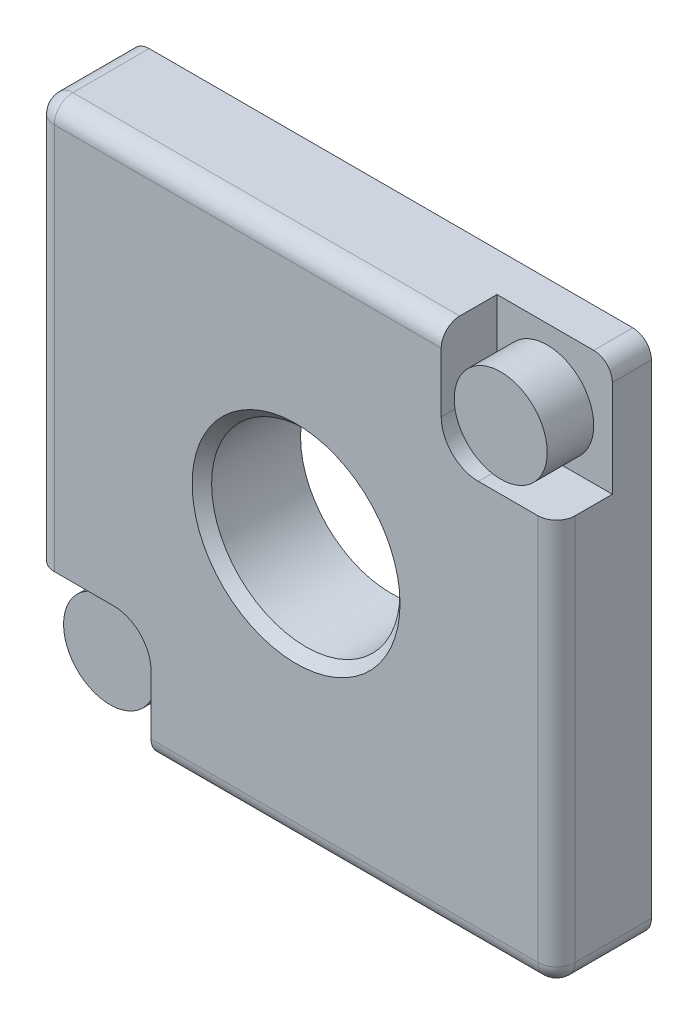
ISO-10303-21;
HEADER;
FILE_DESCRIPTION(('STEP AP214'),'2;1');
FILE_NAME('part.step','',(''),(''),'','','');
FILE_SCHEMA(('AUTOMOTIVE_DESIGN { 1 0 10303 214 1 1 1 1 }'));
ENDSEC;
DATA;
#1=APPLICATION_CONTEXT('core data for automotive mechanical design processes');
#2=APPLICATION_PROTOCOL_DEFINITION('international standard','automotive_design',2000,#1);
#3=PRODUCT_CONTEXT('',#1,'mechanical');
#4=PRODUCT('Part','Part','',(#3));
#5=PRODUCT_RELATED_PRODUCT_CATEGORY('part','',(#4));
#6=PRODUCT_DEFINITION_FORMATION('','',#4);
#7=PRODUCT_DEFINITION_CONTEXT('part definition',#1,'design');
#8=PRODUCT_DEFINITION('design','',#6,#7);
#9=PRODUCT_DEFINITION_SHAPE('','',#8);
#10=(LENGTH_UNIT() NAMED_UNIT(*) SI_UNIT(.MILLI.,.METRE.));
#11=(NAMED_UNIT(*) PLANE_ANGLE_UNIT() SI_UNIT($,.RADIAN.));
#12=(NAMED_UNIT(*) SI_UNIT($,.STERADIAN.) SOLID_ANGLE_UNIT());
#13=UNCERTAINTY_MEASURE_WITH_UNIT(LENGTH_MEASURE(1.E-05),#10,'distance_accuracy_value','');
#14=(GEOMETRIC_REPRESENTATION_CONTEXT(3) GLOBAL_UNCERTAINTY_ASSIGNED_CONTEXT((#13)) GLOBAL_UNIT_ASSIGNED_CONTEXT((#10,
#11,#12)) REPRESENTATION_CONTEXT('',''));
#15=CARTESIAN_POINT('',(0.,0.,0.));
#16=DIRECTION('',(0.,0.,1.));
#17=DIRECTION('',(1.,0.,0.));
#18=AXIS2_PLACEMENT_3D('',#15,#16,#17);
#19=CARTESIAN_POINT('',(-13.,-13.,-5.1));
#20=DIRECTION('',(0.,0.,1.));
#21=DIRECTION('',(1.,0.,0.));
#22=AXIS2_PLACEMENT_3D('',#19,#20,#21);
#23=CYLINDRICAL_SURFACE('',#22,1.);
#24=DIRECTION('',(0.,0.,1.));
#25=VECTOR('',#24,1.);
#26=CARTESIAN_POINT('',(-13.,-14.,-5.1));
#27=LINE('',#26,#25);
#28=CARTESIAN_POINT('',(-13.,-14.0000000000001,-3.));
#29=VERTEX_POINT('',#28);
#30=CARTESIAN_POINT('',(-13.,-14.,-5.1));
#31=VERTEX_POINT('',#30);
#32=EDGE_CURVE('E263',#29,#31,#27,.F.);
#33=ORIENTED_EDGE('',*,*,#32,.F.);
#34=CARTESIAN_POINT('',(-13.,-13.,-3.));
#35=DIRECTION('',(0.,0.,1.));
#36=DIRECTION('',(1.,0.,0.));
#37=AXIS2_PLACEMENT_3D('',#34,#35,#36);
#38=CIRCLE('',#37,1.);
#39=CARTESIAN_POINT('',(-13.9999999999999,-13.,-3.));
#40=VERTEX_POINT('',#39);
#41=EDGE_CURVE('E26',#29,#40,#38,.F.);
#42=ORIENTED_EDGE('',*,*,#41,.T.);
#43=DIRECTION('',(0.,0.,1.));
#44=VECTOR('',#43,1.);
#45=CARTESIAN_POINT('',(-14.,-13.,-5.1));
#46=LINE('',#45,#44);
#47=CARTESIAN_POINT('',(-14.,-13.,-5.1));
#48=VERTEX_POINT('',#47);
#49=EDGE_CURVE('E272',#48,#40,#46,.T.);
#50=ORIENTED_EDGE('',*,*,#49,.F.);
#51=CARTESIAN_POINT('',(-13.,-13.,-5.1));
#52=DIRECTION('',(0.,0.,-1.));
#53=DIRECTION('',(-1.,0.,0.));
#54=AXIS2_PLACEMENT_3D('',#51,#52,#53);
#55=CIRCLE('',#54,1.);
#56=EDGE_CURVE('E257',#31,#48,#55,.T.);
#57=ORIENTED_EDGE('',*,*,#56,.F.);
#58=EDGE_LOOP('',(#33,#42,#50,#57));
#59=FACE_BOUND('',#58,.T.);
#60=ADVANCED_FACE('F17',(#59),#23,.T.);
#61=CARTESIAN_POINT('',(13.,13.,-5.1));
#62=DIRECTION('',(0.,0.,1.));
#63=DIRECTION('',(1.,0.,0.));
#64=AXIS2_PLACEMENT_3D('',#61,#62,#63);
#65=CYLINDRICAL_SURFACE('',#64,1.);
#66=DIRECTION('',(0.,0.,1.));
#67=VECTOR('',#66,1.);
#68=CARTESIAN_POINT('',(13.,14.,-5.1));
#69=LINE('',#68,#67);
#70=CARTESIAN_POINT('',(13.,14.,-3.));
#71=VERTEX_POINT('',#70);
#72=CARTESIAN_POINT('',(13.,14.,-5.1));
#73=VERTEX_POINT('',#72);
#74=EDGE_CURVE('E246',#71,#73,#69,.F.);
#75=ORIENTED_EDGE('',*,*,#74,.F.);
#76=CARTESIAN_POINT('',(13.,13.,-3.));
#77=DIRECTION('',(0.,0.,1.));
#78=DIRECTION('',(1.,0.,0.));
#79=AXIS2_PLACEMENT_3D('',#76,#77,#78);
#80=CIRCLE('',#79,1.);
#81=CARTESIAN_POINT('',(14.,13.,-3.));
#82=VERTEX_POINT('',#81);
#83=EDGE_CURVE('E295',#71,#82,#80,.F.);
#84=ORIENTED_EDGE('',*,*,#83,.T.);
#85=DIRECTION('',(0.,0.,1.));
#86=VECTOR('',#85,1.);
#87=CARTESIAN_POINT('',(14.,13.,-5.1));
#88=LINE('',#87,#86);
#89=CARTESIAN_POINT('',(14.,13.,-5.1));
#90=VERTEX_POINT('',#89);
#91=EDGE_CURVE('E252',#90,#82,#88,.T.);
#92=ORIENTED_EDGE('',*,*,#91,.F.);
#93=CARTESIAN_POINT('',(13.,13.,-5.1));
#94=DIRECTION('',(0.,0.,-1.));
#95=DIRECTION('',(-1.,0.,0.));
#96=AXIS2_PLACEMENT_3D('',#93,#94,#95);
#97=CIRCLE('',#96,1.);
#98=EDGE_CURVE('E261',#73,#90,#97,.T.);
#99=ORIENTED_EDGE('',*,*,#98,.F.);
#100=EDGE_LOOP('',(#75,#84,#92,#99));
#101=FACE_BOUND('',#100,.T.);
#102=ADVANCED_FACE('F328',(#101),#65,.T.);
#103=CARTESIAN_POINT('',(14.,14.,-5.1));
#104=DIRECTION('',(1.,0.,0.));
#105=DIRECTION('',(0.,1.,0.));
#106=AXIS2_PLACEMENT_3D('',#103,#104,#105);
#107=PLANE('',#106);
#108=DIRECTION('',(0.,0.,1.));
#109=VECTOR('',#108,1.);
#110=CARTESIAN_POINT('',(14.,7.8,-3.));
#111=LINE('',#110,#109);
#112=CARTESIAN_POINT('',(14.,7.8,-3.));
#113=VERTEX_POINT('',#112);
#114=CARTESIAN_POINT('',(14.,7.8,-1.));
#115=VERTEX_POINT('',#114);
#116=EDGE_CURVE('E208',#113,#115,#111,.T.);
#117=ORIENTED_EDGE('',*,*,#116,.T.);
#118=DIRECTION('',(0.,1.,0.));
#119=VECTOR('',#118,1.);
#120=CARTESIAN_POINT('',(14.,-14.,-1.));
#121=LINE('',#120,#119);
#122=CARTESIAN_POINT('',(14.,-13.,-1.));
#123=VERTEX_POINT('',#122);
#124=EDGE_CURVE('E250',#115,#123,#121,.F.);
#125=ORIENTED_EDGE('',*,*,#124,.T.);
#126=DIRECTION('',(0.,0.,1.));
#127=VECTOR('',#126,1.);
#128=CARTESIAN_POINT('',(14.,-13.,-5.1));
#129=LINE('',#128,#127);
#130=CARTESIAN_POINT('',(14.,-13.,-5.1));
#131=VERTEX_POINT('',#130);
#132=EDGE_CURVE('E248',#123,#131,#129,.F.);
#133=ORIENTED_EDGE('',*,*,#132,.T.);
#134=DIRECTION('',(0.,1.,0.));
#135=VECTOR('',#134,1.);
#136=CARTESIAN_POINT('',(14.,14.,-5.1));
#137=LINE('',#136,#135);
#138=EDGE_CURVE('E218',#131,#90,#137,.T.);
#139=ORIENTED_EDGE('',*,*,#138,.T.);
#140=ORIENTED_EDGE('',*,*,#91,.T.);
#141=DIRECTION('',(0.,1.,0.));
#142=VECTOR('',#141,1.);
#143=CARTESIAN_POINT('',(14.,14.,-3.));
#144=LINE('',#143,#142);
#145=EDGE_CURVE('E189',#113,#82,#144,.T.);
#146=ORIENTED_EDGE('',*,*,#145,.F.);
#147=EDGE_LOOP('',(#117,#125,#133,#139,#140,#146));
#148=FACE_BOUND('',#147,.T.);
#149=ADVANCED_FACE('F331',(#148),#107,.T.);
#150=CARTESIAN_POINT('',(14.,-14.,-5.1));
#151=DIRECTION('',(0.,-1.,0.));
#152=DIRECTION('',(1.,0.,0.));
#153=AXIS2_PLACEMENT_3D('',#150,#151,#152);
#154=PLANE('',#153);
#155=DIRECTION('',(0.,0.,1.));
#156=VECTOR('',#155,1.);
#157=CARTESIAN_POINT('',(-7.7999999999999,-14.,-3.));
#158=LINE('',#157,#156);
#159=CARTESIAN_POINT('',(-7.7999999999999,-14.,-3.));
#160=VERTEX_POINT('',#159);
#161=CARTESIAN_POINT('',(-7.7999999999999,-14.,-1.));
#162=VERTEX_POINT('',#161);
#163=EDGE_CURVE('E162',#160,#162,#158,.T.);
#164=ORIENTED_EDGE('',*,*,#163,.F.);
#165=DIRECTION('',(1.,0.,0.));
#166=VECTOR('',#165,1.);
#167=CARTESIAN_POINT('',(-13.9999999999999,-14.0000000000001,-3.));
#168=LINE('',#167,#166);
#169=EDGE_CURVE('E149',#29,#160,#168,.T.);
#170=ORIENTED_EDGE('',*,*,#169,.F.);
#171=ORIENTED_EDGE('',*,*,#32,.T.);
#172=DIRECTION('',(1.,0.,0.));
#173=VECTOR('',#172,1.);
#174=CARTESIAN_POINT('',(14.,-14.,-5.1));
#175=LINE('',#174,#173);
#176=CARTESIAN_POINT('',(13.,-14.,-5.1));
#177=VERTEX_POINT('',#176);
#178=EDGE_CURVE('E228',#31,#177,#175,.T.);
#179=ORIENTED_EDGE('',*,*,#178,.T.);
#180=DIRECTION('',(0.,0.,1.));
#181=VECTOR('',#180,1.);
#182=CARTESIAN_POINT('',(13.,-14.,-5.1));
#183=LINE('',#182,#181);
#184=CARTESIAN_POINT('',(13.,-14.,-1.));
#185=VERTEX_POINT('',#184);
#186=EDGE_CURVE('E266',#177,#185,#183,.T.);
#187=ORIENTED_EDGE('',*,*,#186,.T.);
#188=DIRECTION('',(1.,0.,0.));
#189=VECTOR('',#188,1.);
#190=CARTESIAN_POINT('',(-14.,-14.,-1.));
#191=LINE('',#190,#189);
#192=EDGE_CURVE('E172',#185,#162,#191,.F.);
#193=ORIENTED_EDGE('',*,*,#192,.T.);
#194=EDGE_LOOP('',(#164,#170,#171,#179,#187,#193));
#195=FACE_BOUND('',#194,.T.);
#196=ADVANCED_FACE('F170',(#195),#154,.T.);
#197=CARTESIAN_POINT('',(-14.,14.,-5.1));
#198=DIRECTION('',(-1.,0.,0.));
#199=DIRECTION('',(0.,-1.,0.));
#200=AXIS2_PLACEMENT_3D('',#197,#198,#199);
#201=PLANE('',#200);
#202=DIRECTION('',(0.,0.,1.));
#203=VECTOR('',#202,1.);
#204=CARTESIAN_POINT('',(-13.9999999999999,-7.80000000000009,-3.));
#205=LINE('',#204,#203);
#206=CARTESIAN_POINT('',(-13.9999999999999,-7.80000000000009,-3.));
#207=VERTEX_POINT('',#206);
#208=CARTESIAN_POINT('',(-13.9999999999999,-7.80000000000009,-1.));
#209=VERTEX_POINT('',#208);
#210=EDGE_CURVE('E188',#207,#209,#205,.T.);
#211=ORIENTED_EDGE('',*,*,#210,.T.);
#212=DIRECTION('',(0.,-1.,0.));
#213=VECTOR('',#212,1.);
#214=CARTESIAN_POINT('',(-14.,14.,-1.));
#215=LINE('',#214,#213);
#216=CARTESIAN_POINT('',(-14.,13.,-1.));
#217=VERTEX_POINT('',#216);
#218=EDGE_CURVE('E270',#209,#217,#215,.F.);
#219=ORIENTED_EDGE('',*,*,#218,.T.);
#220=DIRECTION('',(0.,0.,1.));
#221=VECTOR('',#220,1.);
#222=CARTESIAN_POINT('',(-14.,13.,-5.1));
#223=LINE('',#222,#221);
#224=CARTESIAN_POINT('',(-14.,13.,-5.1));
#225=VERTEX_POINT('',#224);
#226=EDGE_CURVE('E268',#217,#225,#223,.F.);
#227=ORIENTED_EDGE('',*,*,#226,.T.);
#228=DIRECTION('',(0.,-1.,0.));
#229=VECTOR('',#228,1.);
#230=CARTESIAN_POINT('',(-14.,14.,-5.1));
#231=LINE('',#230,#229);
#232=EDGE_CURVE('E225',#225,#48,#231,.T.);
#233=ORIENTED_EDGE('',*,*,#232,.T.);
#234=ORIENTED_EDGE('',*,*,#49,.T.);
#235=DIRECTION('',(0.,-1.,0.));
#236=VECTOR('',#235,1.);
#237=CARTESIAN_POINT('',(-13.9999999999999,-14.0000000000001,-3.));
#238=LINE('',#237,#236);
#239=EDGE_CURVE('E158',#207,#40,#238,.T.);
#240=ORIENTED_EDGE('',*,*,#239,.F.);
#241=EDGE_LOOP('',(#211,#219,#227,#233,#234,#240));
#242=FACE_BOUND('',#241,.T.);
#243=ADVANCED_FACE('F306',(#242),#201,.T.);
#244=CARTESIAN_POINT('',(14.,14.,-5.1));
#245=DIRECTION('',(0.,1.,0.));
#246=DIRECTION('',(-1.,0.,0.));
#247=AXIS2_PLACEMENT_3D('',#244,#245,#246);
#248=PLANE('',#247);
#249=DIRECTION('',(0.,0.,1.));
#250=VECTOR('',#249,1.);
#251=CARTESIAN_POINT('',(7.8,14.,-3.));
#252=LINE('',#251,#250);
#253=CARTESIAN_POINT('',(7.8,14.,-3.));
#254=VERTEX_POINT('',#253);
#255=CARTESIAN_POINT('',(7.8,14.,-1.));
#256=VERTEX_POINT('',#255);
#257=EDGE_CURVE('E41',#254,#256,#252,.T.);
#258=ORIENTED_EDGE('',*,*,#257,.F.);
#259=DIRECTION('',(-1.,0.,0.));
#260=VECTOR('',#259,1.);
#261=CARTESIAN_POINT('',(14.,14.,-3.));
#262=LINE('',#261,#260);
#263=EDGE_CURVE('E191',#71,#254,#262,.T.);
#264=ORIENTED_EDGE('',*,*,#263,.F.);
#265=ORIENTED_EDGE('',*,*,#74,.T.);
#266=DIRECTION('',(-1.,0.,0.));
#267=VECTOR('',#266,1.);
#268=CARTESIAN_POINT('',(14.,14.,-5.1));
#269=LINE('',#268,#267);
#270=CARTESIAN_POINT('',(-13.,14.,-5.1));
#271=VERTEX_POINT('',#270);
#272=EDGE_CURVE('E221',#73,#271,#269,.T.);
#273=ORIENTED_EDGE('',*,*,#272,.T.);
#274=DIRECTION('',(0.,0.,1.));
#275=VECTOR('',#274,1.);
#276=CARTESIAN_POINT('',(-13.,14.,-5.1));
#277=LINE('',#276,#275);
#278=CARTESIAN_POINT('',(-13.,14.,-1.));
#279=VERTEX_POINT('',#278);
#280=EDGE_CURVE('E241',#271,#279,#277,.T.);
#281=ORIENTED_EDGE('',*,*,#280,.T.);
#282=DIRECTION('',(-1.,0.,0.));
#283=VECTOR('',#282,1.);
#284=CARTESIAN_POINT('',(14.,14.,-1.));
#285=LINE('',#284,#283);
#286=EDGE_CURVE('E243',#279,#256,#285,.F.);
#287=ORIENTED_EDGE('',*,*,#286,.T.);
#288=EDGE_LOOP('',(#258,#264,#265,#273,#281,#287));
#289=FACE_BOUND('',#288,.T.);
#290=ADVANCED_FACE('F321',(#289),#248,.T.);
#291=CARTESIAN_POINT('',(14.,-14.,-5.1));
#292=DIRECTION('',(0.,0.,-1.));
#293=DIRECTION('',(-1.,0.,0.));
#294=AXIS2_PLACEMENT_3D('',#291,#292,#293);
#295=PLANE('',#294);
#296=CARTESIAN_POINT('',(0.,0.,-5.1));
#297=DIRECTION('',(0.,0.,-1.));
#298=DIRECTION('',(-1.,0.,0.));
#299=AXIS2_PLACEMENT_3D('',#296,#297,#298);
#300=CIRCLE('',#299,4.86105873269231);
#301=CARTESIAN_POINT('',(-4.86105873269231,0.,-5.1));
#302=VERTEX_POINT('',#301);
#303=EDGE_CURVE('E21',#302,#302,#300,.F.);
#304=ORIENTED_EDGE('',*,*,#303,.T.);
#305=EDGE_LOOP('',(#304));
#306=FACE_BOUND('',#305,.T.);
#307=ORIENTED_EDGE('',*,*,#272,.F.);
#308=ORIENTED_EDGE('',*,*,#98,.T.);
#309=ORIENTED_EDGE('',*,*,#138,.F.);
#310=CARTESIAN_POINT('',(13.,-13.,-5.1));
#311=DIRECTION('',(0.,0.,-1.));
#312=DIRECTION('',(-1.,0.,0.));
#313=AXIS2_PLACEMENT_3D('',#310,#311,#312);
#314=CIRCLE('',#313,1.);
#315=EDGE_CURVE('E259',#131,#177,#314,.T.);
#316=ORIENTED_EDGE('',*,*,#315,.T.);
#317=ORIENTED_EDGE('',*,*,#178,.F.);
#318=ORIENTED_EDGE('',*,*,#56,.T.);
#319=ORIENTED_EDGE('',*,*,#232,.F.);
#320=CARTESIAN_POINT('',(-13.,13.,-5.1));
#321=DIRECTION('',(0.,0.,-1.));
#322=DIRECTION('',(-1.,0.,0.));
#323=AXIS2_PLACEMENT_3D('',#320,#321,#322);
#324=CIRCLE('',#323,1.);
#325=EDGE_CURVE('E255',#225,#271,#324,.T.);
#326=ORIENTED_EDGE('',*,*,#325,.T.);
#327=EDGE_LOOP('',(#307,#308,#309,#316,#317,#318,#319,#326));
#328=FACE_BOUND('',#327,.T.);
#329=ADVANCED_FACE('F312',(#306,#328),#295,.T.);
#330=CARTESIAN_POINT('',(14.,-14.,0.));
#331=DIRECTION('',(0.,0.,-1.));
#332=DIRECTION('',(-1.,0.,0.));
#333=AXIS2_PLACEMENT_3D('',#330,#331,#332);
#334=PLANE('',#333);
#335=CARTESIAN_POINT('',(0.,0.,0.));
#336=DIRECTION('',(0.,0.,1.));
#337=DIRECTION('',(1.,0.,0.));
#338=AXIS2_PLACEMENT_3D('',#335,#336,#337);
#339=CIRCLE('',#338,5.58716106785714);
#340=CARTESIAN_POINT('',(5.58716106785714,0.,0.));
#341=VERTEX_POINT('',#340);
#342=EDGE_CURVE('E372',#341,#341,#339,.T.);
#343=ORIENTED_EDGE('',*,*,#342,.F.);
#344=EDGE_LOOP('',(#343));
#345=FACE_BOUND('',#344,.T.);
#346=DIRECTION('',(0.,-1.,0.));
#347=VECTOR('',#346,1.);
#348=CARTESIAN_POINT('',(-13.,-14.,0.));
#349=LINE('',#348,#347);
#350=CARTESIAN_POINT('',(-13.,13.,0.));
#351=VERTEX_POINT('',#350);
#352=CARTESIAN_POINT('',(-13.,-7.80000000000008,0.));
#353=VERTEX_POINT('',#352);
#354=EDGE_CURVE('E231',#351,#353,#349,.T.);
#355=ORIENTED_EDGE('',*,*,#354,.T.);
#356=DIRECTION('',(-1.,0.,0.));
#357=VECTOR('',#356,1.);
#358=CARTESIAN_POINT('',(-13.9999999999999,-7.80000000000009,0.));
#359=LINE('',#358,#357);
#360=CARTESIAN_POINT('',(-9.79999999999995,-7.80000000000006,0.));
#361=VERTEX_POINT('',#360);
#362=EDGE_CURVE('E33',#361,#353,#359,.T.);
#363=ORIENTED_EDGE('',*,*,#362,.F.);
#364=CARTESIAN_POINT('',(-9.79999999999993,-9.80000000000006,0.));
#365=DIRECTION('',(0.,0.,1.));
#366=DIRECTION('',(-1.,0.,0.));
#367=AXIS2_PLACEMENT_3D('',#364,#365,#366);
#368=CIRCLE('',#367,2.);
#369=CARTESIAN_POINT('',(-7.79999999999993,-9.80000000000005,0.));
#370=VERTEX_POINT('',#369);
#371=EDGE_CURVE('E348',#370,#361,#368,.T.);
#372=ORIENTED_EDGE('',*,*,#371,.F.);
#373=DIRECTION('',(0.,1.,0.));
#374=VECTOR('',#373,1.);
#375=CARTESIAN_POINT('',(-7.7999999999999,-14.,0.));
#376=LINE('',#375,#374);
#377=CARTESIAN_POINT('',(-7.79999999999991,-13.,0.));
#378=VERTEX_POINT('',#377);
#379=EDGE_CURVE('E343',#378,#370,#376,.T.);
#380=ORIENTED_EDGE('',*,*,#379,.F.);
#381=DIRECTION('',(1.,0.,0.));
#382=VECTOR('',#381,1.);
#383=CARTESIAN_POINT('',(14.,-13.,0.));
#384=LINE('',#383,#382);
#385=CARTESIAN_POINT('',(13.,-13.,0.));
#386=VERTEX_POINT('',#385);
#387=EDGE_CURVE('E234',#378,#386,#384,.T.);
#388=ORIENTED_EDGE('',*,*,#387,.T.);
#389=DIRECTION('',(0.,1.,0.));
#390=VECTOR('',#389,1.);
#391=CARTESIAN_POINT('',(13.,14.,0.));
#392=LINE('',#391,#390);
#393=CARTESIAN_POINT('',(13.,7.8,0.));
#394=VERTEX_POINT('',#393);
#395=EDGE_CURVE('E236',#386,#394,#392,.T.);
#396=ORIENTED_EDGE('',*,*,#395,.T.);
#397=DIRECTION('',(1.,0.,0.));
#398=VECTOR('',#397,1.);
#399=CARTESIAN_POINT('',(14.,7.8,0.));
#400=LINE('',#399,#398);
#401=CARTESIAN_POINT('',(9.8,7.8,0.));
#402=VERTEX_POINT('',#401);
#403=EDGE_CURVE('E192',#402,#394,#400,.T.);
#404=ORIENTED_EDGE('',*,*,#403,.F.);
#405=CARTESIAN_POINT('',(9.8,9.8,0.));
#406=DIRECTION('',(0.,0.,1.));
#407=DIRECTION('',(1.,0.,0.));
#408=AXIS2_PLACEMENT_3D('',#405,#406,#407);
#409=CIRCLE('',#408,2.);
#410=CARTESIAN_POINT('',(7.8,9.8,0.));
#411=VERTEX_POINT('',#410);
#412=EDGE_CURVE('E204',#411,#402,#409,.T.);
#413=ORIENTED_EDGE('',*,*,#412,.F.);
#414=DIRECTION('',(0.,-1.,0.));
#415=VECTOR('',#414,1.);
#416=CARTESIAN_POINT('',(7.8,14.,0.));
#417=LINE('',#416,#415);
#418=CARTESIAN_POINT('',(7.8,13.,0.));
#419=VERTEX_POINT('',#418);
#420=EDGE_CURVE('E184',#419,#411,#417,.T.);
#421=ORIENTED_EDGE('',*,*,#420,.F.);
#422=DIRECTION('',(-1.,0.,0.));
#423=VECTOR('',#422,1.);
#424=CARTESIAN_POINT('',(-14.,13.,0.));
#425=LINE('',#424,#423);
#426=EDGE_CURVE('E239',#419,#351,#425,.T.);
#427=ORIENTED_EDGE('',*,*,#426,.T.);
#428=EDGE_LOOP('',(#355,#363,#372,#380,#388,#396,#404,#413,#421,#427));
#429=FACE_BOUND('',#428,.T.);
#430=ADVANCED_FACE('F346',(#345,#429),#334,.F.);
#431=CARTESIAN_POINT('',(13.,-13.,-5.1));
#432=DIRECTION('',(0.,0.,1.));
#433=DIRECTION('',(1.,0.,0.));
#434=AXIS2_PLACEMENT_3D('',#431,#432,#433);
#435=CYLINDRICAL_SURFACE('',#434,1.);
#436=ORIENTED_EDGE('',*,*,#315,.F.);
#437=ORIENTED_EDGE('',*,*,#132,.F.);
#438=CARTESIAN_POINT('',(13.,-13.,-1.));
#439=DIRECTION('',(0.,0.,1.));
#440=DIRECTION('',(1.,0.,0.));
#441=AXIS2_PLACEMENT_3D('',#438,#439,#440);
#442=CIRCLE('',#441,1.);
#443=EDGE_CURVE('E222',#185,#123,#442,.T.);
#444=ORIENTED_EDGE('',*,*,#443,.F.);
#445=ORIENTED_EDGE('',*,*,#186,.F.);
#446=EDGE_LOOP('',(#436,#437,#444,#445));
#447=FACE_BOUND('',#446,.T.);
#448=ADVANCED_FACE('F19',(#447),#435,.T.);
#449=CARTESIAN_POINT('',(14.,-13.,-1.));
#450=DIRECTION('',(-1.,0.,0.));
#451=DIRECTION('',(0.,-1.,0.));
#452=AXIS2_PLACEMENT_3D('',#449,#450,#451);
#453=CYLINDRICAL_SURFACE('',#452,1.);
#454=CARTESIAN_POINT('',(-7.79999999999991,-13.,-1.));
#455=DIRECTION('',(1.,0.,0.));
#456=DIRECTION('',(0.,1.,0.));
#457=AXIS2_PLACEMENT_3D('',#454,#455,#456);
#458=CIRCLE('',#457,1.);
#459=EDGE_CURVE('E11',#162,#378,#458,.F.);
#460=ORIENTED_EDGE('',*,*,#459,.F.);
#461=ORIENTED_EDGE('',*,*,#192,.F.);
#462=CARTESIAN_POINT('',(13.,-13.,-1.));
#463=DIRECTION('',(1.,0.,0.));
#464=DIRECTION('',(0.,0.,-1.));
#465=AXIS2_PLACEMENT_3D('',#462,#463,#464);
#466=CIRCLE('',#465,1.);
#467=EDGE_CURVE('E287',#386,#185,#466,.T.);
#468=ORIENTED_EDGE('',*,*,#467,.F.);
#469=ORIENTED_EDGE('',*,*,#387,.F.);
#470=EDGE_LOOP('',(#460,#461,#468,#469));
#471=FACE_BOUND('',#470,.T.);
#472=ADVANCED_FACE('F339',(#471),#453,.T.);
#473=CARTESIAN_POINT('',(13.,-13.,-1.));
#474=DIRECTION('',(0.,0.,1.));
#475=DIRECTION('',(1.,0.,0.));
#476=AXIS2_PLACEMENT_3D('',#473,#474,#475);
#477=SPHERICAL_SURFACE('',#476,1.);
#478=ORIENTED_EDGE('',*,*,#467,.T.);
#479=ORIENTED_EDGE('',*,*,#443,.T.);
#480=CARTESIAN_POINT('',(13.,-13.,-1.));
#481=DIRECTION('',(0.,-1.,0.));
#482=DIRECTION('',(0.,0.,-1.));
#483=AXIS2_PLACEMENT_3D('',#480,#481,#482);
#484=CIRCLE('',#483,1.);
#485=EDGE_CURVE('E284',#386,#123,#484,.F.);
#486=ORIENTED_EDGE('',*,*,#485,.F.);
#487=EDGE_LOOP('',(#478,#479,#486));
#488=FACE_BOUND('',#487,.T.);
#489=ADVANCED_FACE('F406',(#488),#477,.T.);
#490=CARTESIAN_POINT('',(13.,-14.,-1.));
#491=DIRECTION('',(0.,-1.,0.));
#492=DIRECTION('',(1.,0.,0.));
#493=AXIS2_PLACEMENT_3D('',#490,#491,#492);
#494=CYLINDRICAL_SURFACE('',#493,1.);
#495=CARTESIAN_POINT('',(13.,7.8,-1.));
#496=DIRECTION('',(0.,-1.,0.));
#497=DIRECTION('',(1.,0.,0.));
#498=AXIS2_PLACEMENT_3D('',#495,#496,#497);
#499=CIRCLE('',#498,1.);
#500=EDGE_CURVE('E293',#394,#115,#499,.F.);
#501=ORIENTED_EDGE('',*,*,#500,.F.);
#502=ORIENTED_EDGE('',*,*,#395,.F.);
#503=ORIENTED_EDGE('',*,*,#485,.T.);
#504=ORIENTED_EDGE('',*,*,#124,.F.);
#505=EDGE_LOOP('',(#501,#502,#503,#504));
#506=FACE_BOUND('',#505,.T.);
#507=ADVANCED_FACE('F413',(#506),#494,.T.);
#508=CARTESIAN_POINT('',(-13.,-14.,-1.));
#509=DIRECTION('',(0.,1.,0.));
#510=DIRECTION('',(-1.,0.,0.));
#511=AXIS2_PLACEMENT_3D('',#508,#509,#510);
#512=CYLINDRICAL_SURFACE('',#511,1.);
#513=CARTESIAN_POINT('',(-13.,-7.80000000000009,-1.));
#514=DIRECTION('',(0.,1.,0.));
#515=DIRECTION('',(-1.,0.,0.));
#516=AXIS2_PLACEMENT_3D('',#513,#514,#515);
#517=CIRCLE('',#516,1.);
#518=EDGE_CURVE('E298',#353,#209,#517,.F.);
#519=ORIENTED_EDGE('',*,*,#518,.F.);
#520=ORIENTED_EDGE('',*,*,#354,.F.);
#521=CARTESIAN_POINT('',(-13.,13.,-1.));
#522=DIRECTION('',(0.,1.,0.));
#523=DIRECTION('',(0.,0.,1.));
#524=AXIS2_PLACEMENT_3D('',#521,#522,#523);
#525=CIRCLE('',#524,1.);
#526=EDGE_CURVE('E281',#217,#351,#525,.T.);
#527=ORIENTED_EDGE('',*,*,#526,.F.);
#528=ORIENTED_EDGE('',*,*,#218,.F.);
#529=EDGE_LOOP('',(#519,#520,#527,#528));
#530=FACE_BOUND('',#529,.T.);
#531=ADVANCED_FACE('F366',(#530),#512,.T.);
#532=CARTESIAN_POINT('',(-13.,13.,-5.1));
#533=DIRECTION('',(0.,0.,1.));
#534=DIRECTION('',(1.,0.,0.));
#535=AXIS2_PLACEMENT_3D('',#532,#533,#534);
#536=CYLINDRICAL_SURFACE('',#535,1.);
#537=ORIENTED_EDGE('',*,*,#325,.F.);
#538=ORIENTED_EDGE('',*,*,#226,.F.);
#539=CARTESIAN_POINT('',(-13.,13.,-1.));
#540=DIRECTION('',(0.,0.,1.));
#541=DIRECTION('',(1.,0.,0.));
#542=AXIS2_PLACEMENT_3D('',#539,#540,#541);
#543=CIRCLE('',#542,1.);
#544=EDGE_CURVE('E278',#279,#217,#543,.T.);
#545=ORIENTED_EDGE('',*,*,#544,.F.);
#546=ORIENTED_EDGE('',*,*,#280,.F.);
#547=EDGE_LOOP('',(#537,#538,#545,#546));
#548=FACE_BOUND('',#547,.T.);
#549=ADVANCED_FACE('F316',(#548),#536,.T.);
#550=CARTESIAN_POINT('',(-13.,13.,-1.));
#551=DIRECTION('',(0.,0.,1.));
#552=DIRECTION('',(1.,0.,0.));
#553=AXIS2_PLACEMENT_3D('',#550,#551,#552);
#554=SPHERICAL_SURFACE('',#553,1.);
#555=ORIENTED_EDGE('',*,*,#544,.T.);
#556=ORIENTED_EDGE('',*,*,#526,.T.);
#557=CARTESIAN_POINT('',(-13.,13.,-1.));
#558=DIRECTION('',(-1.,0.,0.));
#559=DIRECTION('',(0.,-1.,0.));
#560=AXIS2_PLACEMENT_3D('',#557,#558,#559);
#561=CIRCLE('',#560,1.);
#562=EDGE_CURVE('E211',#279,#351,#561,.F.);
#563=ORIENTED_EDGE('',*,*,#562,.F.);
#564=EDGE_LOOP('',(#555,#556,#563));
#565=FACE_BOUND('',#564,.T.);
#566=ADVANCED_FACE('F442',(#565),#554,.T.);
#567=CARTESIAN_POINT('',(14.,13.,-1.));
#568=DIRECTION('',(1.,0.,0.));
#569=DIRECTION('',(0.,1.,0.));
#570=AXIS2_PLACEMENT_3D('',#567,#568,#569);
#571=CYLINDRICAL_SURFACE('',#570,1.);
#572=CARTESIAN_POINT('',(7.8,13.,-1.));
#573=DIRECTION('',(-1.,0.,0.));
#574=DIRECTION('',(0.,-1.,0.));
#575=AXIS2_PLACEMENT_3D('',#572,#573,#574);
#576=CIRCLE('',#575,1.);
#577=EDGE_CURVE('E275',#256,#419,#576,.F.);
#578=ORIENTED_EDGE('',*,*,#577,.F.);
#579=ORIENTED_EDGE('',*,*,#286,.F.);
#580=ORIENTED_EDGE('',*,*,#562,.T.);
#581=ORIENTED_EDGE('',*,*,#426,.F.);
#582=EDGE_LOOP('',(#578,#579,#580,#581));
#583=FACE_BOUND('',#582,.T.);
#584=ADVANCED_FACE('F438',(#583),#571,.T.);
#585=CARTESIAN_POINT('',(14.,7.8,-3.));
#586=DIRECTION('',(0.,-1.,0.));
#587=DIRECTION('',(1.,0.,0.));
#588=AXIS2_PLACEMENT_3D('',#585,#586,#587);
#589=PLANE('',#588);
#590=ORIENTED_EDGE('',*,*,#500,.T.);
#591=ORIENTED_EDGE('',*,*,#116,.F.);
#592=DIRECTION('',(1.,0.,0.));
#593=VECTOR('',#592,1.);
#594=CARTESIAN_POINT('',(14.,7.8,-3.));
#595=LINE('',#594,#593);
#596=CARTESIAN_POINT('',(9.8,7.8,-3.));
#597=VERTEX_POINT('',#596);
#598=EDGE_CURVE('E200',#597,#113,#595,.T.);
#599=ORIENTED_EDGE('',*,*,#598,.F.);
#600=DIRECTION('',(0.,0.,1.));
#601=VECTOR('',#600,1.);
#602=CARTESIAN_POINT('',(9.8,7.8,-3.));
#603=LINE('',#602,#601);
#604=EDGE_CURVE('E212',#597,#402,#603,.T.);
#605=ORIENTED_EDGE('',*,*,#604,.T.);
#606=ORIENTED_EDGE('',*,*,#403,.T.);
#607=EDGE_LOOP('',(#590,#591,#599,#605,#606));
#608=FACE_BOUND('',#607,.T.);
#609=ADVANCED_FACE('F441',(#608),#589,.F.);
#610=CARTESIAN_POINT('',(9.8,9.8,-3.));
#611=DIRECTION('',(0.,0.,1.));
#612=DIRECTION('',(1.,0.,0.));
#613=AXIS2_PLACEMENT_3D('',#610,#611,#612);
#614=CYLINDRICAL_SURFACE('',#613,2.);
#615=ORIENTED_EDGE('',*,*,#412,.T.);
#616=ORIENTED_EDGE('',*,*,#604,.F.);
#617=CARTESIAN_POINT('',(9.8,9.8,-3.));
#618=DIRECTION('',(0.,0.,1.));
#619=DIRECTION('',(1.,0.,0.));
#620=AXIS2_PLACEMENT_3D('',#617,#618,#619);
#621=CIRCLE('',#620,2.);
#622=CARTESIAN_POINT('',(7.8,9.8,-3.));
#623=VERTEX_POINT('',#622);
#624=EDGE_CURVE('E197',#623,#597,#621,.T.);
#625=ORIENTED_EDGE('',*,*,#624,.F.);
#626=DIRECTION('',(0.,0.,1.));
#627=VECTOR('',#626,1.);
#628=CARTESIAN_POINT('',(7.8,9.8,-3.));
#629=LINE('',#628,#627);
#630=EDGE_CURVE('E214',#623,#411,#629,.T.);
#631=ORIENTED_EDGE('',*,*,#630,.T.);
#632=EDGE_LOOP('',(#615,#616,#625,#631));
#633=FACE_BOUND('',#632,.T.);
#634=ADVANCED_FACE('F465',(#633),#614,.F.);
#635=CARTESIAN_POINT('',(7.8,14.,-3.));
#636=DIRECTION('',(-1.,0.,0.));
#637=DIRECTION('',(0.,-1.,0.));
#638=AXIS2_PLACEMENT_3D('',#635,#636,#637);
#639=PLANE('',#638);
#640=ORIENTED_EDGE('',*,*,#577,.T.);
#641=ORIENTED_EDGE('',*,*,#420,.T.);
#642=ORIENTED_EDGE('',*,*,#630,.F.);
#643=DIRECTION('',(0.,-1.,0.));
#644=VECTOR('',#643,1.);
#645=CARTESIAN_POINT('',(7.8,14.,-3.));
#646=LINE('',#645,#644);
#647=EDGE_CURVE('E194',#254,#623,#646,.T.);
#648=ORIENTED_EDGE('',*,*,#647,.F.);
#649=ORIENTED_EDGE('',*,*,#257,.T.);
#650=EDGE_LOOP('',(#640,#641,#642,#648,#649));
#651=FACE_BOUND('',#650,.T.);
#652=ADVANCED_FACE('F466',(#651),#639,.F.);
#653=CARTESIAN_POINT('',(9.8,9.8,-3.));
#654=DIRECTION('',(0.,0.,1.));
#655=DIRECTION('',(1.,0.,0.));
#656=AXIS2_PLACEMENT_3D('',#653,#654,#655);
#657=PLANE('',#656);
#658=CARTESIAN_POINT('',(10.5,10.5,-3.));
#659=DIRECTION('',(0.,0.,1.));
#660=DIRECTION('',(1.,0.,0.));
#661=AXIS2_PLACEMENT_3D('',#658,#659,#660);
#662=CIRCLE('',#661,2.5);
#663=CARTESIAN_POINT('',(13.,10.5,-3.));
#664=VERTEX_POINT('',#663);
#665=EDGE_CURVE('E185',#664,#664,#662,.T.);
#666=ORIENTED_EDGE('',*,*,#665,.F.);
#667=EDGE_LOOP('',(#666));
#668=FACE_BOUND('',#667,.T.);
#669=ORIENTED_EDGE('',*,*,#263,.T.);
#670=ORIENTED_EDGE('',*,*,#647,.T.);
#671=ORIENTED_EDGE('',*,*,#624,.T.);
#672=ORIENTED_EDGE('',*,*,#598,.T.);
#673=ORIENTED_EDGE('',*,*,#145,.T.);
#674=ORIENTED_EDGE('',*,*,#83,.F.);
#675=EDGE_LOOP('',(#669,#670,#671,#672,#673,#674));
#676=FACE_BOUND('',#675,.T.);
#677=ADVANCED_FACE('F469',(#668,#676),#657,.T.);
#678=CARTESIAN_POINT('',(10.5,10.5,-0.5));
#679=DIRECTION('',(0.,0.,-1.));
#680=DIRECTION('',(-1.,0.,0.));
#681=AXIS2_PLACEMENT_3D('',#678,#679,#680);
#682=CYLINDRICAL_SURFACE('',#681,2.5);
#683=CARTESIAN_POINT('',(10.5,10.5,-0.5));
#684=DIRECTION('',(0.,0.,1.));
#685=DIRECTION('',(1.,0.,0.));
#686=AXIS2_PLACEMENT_3D('',#683,#684,#685);
#687=CIRCLE('',#686,2.5);
#688=CARTESIAN_POINT('',(13.,10.5,-0.5));
#689=VERTEX_POINT('',#688);
#690=EDGE_CURVE('E181',#689,#689,#687,.T.);
#691=ORIENTED_EDGE('',*,*,#690,.F.);
#692=EDGE_LOOP('',(#691));
#693=FACE_BOUND('',#692,.T.);
#694=ORIENTED_EDGE('',*,*,#665,.T.);
#695=EDGE_LOOP('',(#694));
#696=FACE_BOUND('',#695,.T.);
#697=ADVANCED_FACE('F471',(#693,#696),#682,.T.);
#698=CARTESIAN_POINT('',(10.5,10.5,-0.5));
#699=DIRECTION('',(0.,0.,1.));
#700=DIRECTION('',(1.,0.,0.));
#701=AXIS2_PLACEMENT_3D('',#698,#699,#700);
#702=PLANE('',#701);
#703=ORIENTED_EDGE('',*,*,#690,.T.);
#704=EDGE_LOOP('',(#703));
#705=FACE_BOUND('',#704,.T.);
#706=ADVANCED_FACE('F479',(#705),#702,.T.);
#707=CARTESIAN_POINT('',(-13.9999999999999,-7.80000000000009,-3.));
#708=DIRECTION('',(0.,1.,0.));
#709=DIRECTION('',(-1.,0.,0.));
#710=AXIS2_PLACEMENT_3D('',#707,#708,#709);
#711=PLANE('',#710);
#712=ORIENTED_EDGE('',*,*,#518,.T.);
#713=ORIENTED_EDGE('',*,*,#210,.F.);
#714=DIRECTION('',(-1.,0.,0.));
#715=VECTOR('',#714,1.);
#716=CARTESIAN_POINT('',(-13.9999999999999,-7.80000000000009,-3.));
#717=LINE('',#716,#715);
#718=CARTESIAN_POINT('',(-9.79999999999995,-7.80000000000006,-3.));
#719=VERTEX_POINT('',#718);
#720=EDGE_CURVE('E173',#719,#207,#717,.T.);
#721=ORIENTED_EDGE('',*,*,#720,.F.);
#722=DIRECTION('',(0.,0.,1.));
#723=VECTOR('',#722,1.);
#724=CARTESIAN_POINT('',(-9.79999999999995,-7.80000000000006,-3.));
#725=LINE('',#724,#723);
#726=EDGE_CURVE('E175',#719,#361,#725,.T.);
#727=ORIENTED_EDGE('',*,*,#726,.T.);
#728=ORIENTED_EDGE('',*,*,#362,.T.);
#729=EDGE_LOOP('',(#712,#713,#721,#727,#728));
#730=FACE_BOUND('',#729,.T.);
#731=ADVANCED_FACE('F359',(#730),#711,.F.);
#732=CARTESIAN_POINT('',(-9.79999999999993,-9.80000000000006,-3.));
#733=DIRECTION('',(0.,0.,1.));
#734=DIRECTION('',(1.,0.,0.));
#735=AXIS2_PLACEMENT_3D('',#732,#733,#734);
#736=CYLINDRICAL_SURFACE('',#735,2.);
#737=ORIENTED_EDGE('',*,*,#371,.T.);
#738=ORIENTED_EDGE('',*,*,#726,.F.);
#739=CARTESIAN_POINT('',(-9.79999999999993,-9.80000000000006,-3.));
#740=DIRECTION('',(0.,0.,1.));
#741=DIRECTION('',(-1.,0.,0.));
#742=AXIS2_PLACEMENT_3D('',#739,#740,#741);
#743=CIRCLE('',#742,2.);
#744=CARTESIAN_POINT('',(-7.79999999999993,-9.80000000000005,-3.));
#745=VERTEX_POINT('',#744);
#746=EDGE_CURVE('E167',#745,#719,#743,.T.);
#747=ORIENTED_EDGE('',*,*,#746,.F.);
#748=DIRECTION('',(0.,0.,1.));
#749=VECTOR('',#748,1.);
#750=CARTESIAN_POINT('',(-7.79999999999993,-9.80000000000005,-3.));
#751=LINE('',#750,#749);
#752=EDGE_CURVE('E165',#745,#370,#751,.T.);
#753=ORIENTED_EDGE('',*,*,#752,.T.);
#754=EDGE_LOOP('',(#737,#738,#747,#753));
#755=FACE_BOUND('',#754,.T.);
#756=ADVANCED_FACE('F361',(#755),#736,.F.);
#757=CARTESIAN_POINT('',(-7.7999999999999,-14.,-3.));
#758=DIRECTION('',(1.,0.,0.));
#759=DIRECTION('',(0.,1.,0.));
#760=AXIS2_PLACEMENT_3D('',#757,#758,#759);
#761=PLANE('',#760);
#762=ORIENTED_EDGE('',*,*,#459,.T.);
#763=ORIENTED_EDGE('',*,*,#379,.T.);
#764=ORIENTED_EDGE('',*,*,#752,.F.);
#765=DIRECTION('',(0.,1.,0.));
#766=VECTOR('',#765,1.);
#767=CARTESIAN_POINT('',(-7.7999999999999,-14.,-3.));
#768=LINE('',#767,#766);
#769=EDGE_CURVE('E153',#160,#745,#768,.T.);
#770=ORIENTED_EDGE('',*,*,#769,.F.);
#771=ORIENTED_EDGE('',*,*,#163,.T.);
#772=EDGE_LOOP('',(#762,#763,#764,#770,#771));
#773=FACE_BOUND('',#772,.T.);
#774=ADVANCED_FACE('F161',(#773),#761,.F.);
#775=CARTESIAN_POINT('',(-9.79999999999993,-9.80000000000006,-3.));
#776=DIRECTION('',(0.,0.,1.));
#777=DIRECTION('',(-1.,0.,0.));
#778=AXIS2_PLACEMENT_3D('',#775,#776,#777);
#779=PLANE('',#778);
#780=CARTESIAN_POINT('',(-10.4999999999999,-10.5000000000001,-3.));
#781=DIRECTION('',(0.,0.,1.));
#782=DIRECTION('',(-1.,0.,0.));
#783=AXIS2_PLACEMENT_3D('',#780,#781,#782);
#784=CIRCLE('',#783,2.5);
#785=CARTESIAN_POINT('',(-12.9999999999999,-10.5000000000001,-3.));
#786=VERTEX_POINT('',#785);
#787=EDGE_CURVE('E353',#786,#786,#784,.T.);
#788=ORIENTED_EDGE('',*,*,#787,.F.);
#789=EDGE_LOOP('',(#788));
#790=FACE_BOUND('',#789,.T.);
#791=ORIENTED_EDGE('',*,*,#169,.T.);
#792=ORIENTED_EDGE('',*,*,#769,.T.);
#793=ORIENTED_EDGE('',*,*,#746,.T.);
#794=ORIENTED_EDGE('',*,*,#720,.T.);
#795=ORIENTED_EDGE('',*,*,#239,.T.);
#796=ORIENTED_EDGE('',*,*,#41,.F.);
#797=EDGE_LOOP('',(#791,#792,#793,#794,#795,#796));
#798=FACE_BOUND('',#797,.T.);
#799=ADVANCED_FACE('F151',(#790,#798),#779,.T.);
#800=CARTESIAN_POINT('',(-10.4999999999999,-10.5000000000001,-0.5));
#801=DIRECTION('',(0.,0.,-1.));
#802=DIRECTION('',(-1.,0.,0.));
#803=AXIS2_PLACEMENT_3D('',#800,#801,#802);
#804=CYLINDRICAL_SURFACE('',#803,2.5);
#805=CARTESIAN_POINT('',(-10.4999999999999,-10.5000000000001,-0.5));
#806=DIRECTION('',(0.,0.,1.));
#807=DIRECTION('',(-1.,0.,0.));
#808=AXIS2_PLACEMENT_3D('',#805,#806,#807);
#809=CIRCLE('',#808,2.5);
#810=CARTESIAN_POINT('',(-12.9999999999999,-10.5000000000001,-0.5));
#811=VERTEX_POINT('',#810);
#812=EDGE_CURVE('E349',#811,#811,#809,.T.);
#813=ORIENTED_EDGE('',*,*,#812,.F.);
#814=EDGE_LOOP('',(#813));
#815=FACE_BOUND('',#814,.T.);
#816=ORIENTED_EDGE('',*,*,#787,.T.);
#817=EDGE_LOOP('',(#816));
#818=FACE_BOUND('',#817,.T.);
#819=ADVANCED_FACE('F394',(#815,#818),#804,.T.);
#820=CARTESIAN_POINT('',(-10.4999999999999,-10.5000000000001,-0.5));
#821=DIRECTION('',(0.,0.,1.));
#822=DIRECTION('',(-1.,0.,0.));
#823=AXIS2_PLACEMENT_3D('',#820,#821,#822);
#824=PLANE('',#823);
#825=ORIENTED_EDGE('',*,*,#812,.T.);
#826=EDGE_LOOP('',(#825));
#827=FACE_BOUND('',#826,.T.);
#828=ADVANCED_FACE('F383',(#827),#824,.T.);
#829=CARTESIAN_POINT('',(0.,0.,-0.523195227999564));
#830=DIRECTION('',(0.,0.,1.));
#831=DIRECTION('',(1.,0.,0.));
#832=AXIS2_PLACEMENT_3D('',#829,#830,#831);
#833=CONICAL_SURFACE('',#832,5.06396583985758,0.785398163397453);
#834=ORIENTED_EDGE('',*,*,#342,.T.);
#835=EDGE_LOOP('',(#834));
#836=FACE_BOUND('',#835,.T.);
#837=CARTESIAN_POINT('',(0.,0.,-0.523195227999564));
#838=DIRECTION('',(0.,0.,1.));
#839=DIRECTION('',(1.,0.,0.));
#840=AXIS2_PLACEMENT_3D('',#837,#838,#839);
#841=CIRCLE('',#840,5.06396583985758);
#842=CARTESIAN_POINT('',(5.06396583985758,0.,-0.523195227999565));
#843=VERTEX_POINT('',#842);
#844=EDGE_CURVE('E375',#843,#843,#841,.T.);
#845=ORIENTED_EDGE('',*,*,#844,.F.);
#846=EDGE_LOOP('',(#845));
#847=FACE_BOUND('',#846,.T.);
#848=ADVANCED_FACE('F381',(#836,#847),#833,.F.);
#849=CARTESIAN_POINT('',(0.,0.,-6.5));
#850=DIRECTION('',(0.,0.,1.));
#851=DIRECTION('',(1.,0.,0.));
#852=AXIS2_PLACEMENT_3D('',#849,#850,#851);
#853=CONICAL_SURFACE('',#852,4.798991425,0.0443047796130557);
#854=ORIENTED_EDGE('',*,*,#303,.F.);
#855=EDGE_LOOP('',(#854));
#856=FACE_BOUND('',#855,.T.);
#857=ORIENTED_EDGE('',*,*,#844,.T.);
#858=EDGE_LOOP('',(#857));
#859=FACE_BOUND('',#858,.T.);
#860=ADVANCED_FACE('F379',(#856,#859),#853,.F.);
#861=CLOSED_SHELL('',(#60,#102,#149,#196,#243,#290,#329,#430,#448,#472,#489,#507,#531,#549,#566,
#584,#609,#634,#652,#677,#697,#706,#731,#756,#774,#799,#819,#828,#848,#860));
#862=MANIFOLD_SOLID_BREP('B1',#861);
#863=ADVANCED_BREP_SHAPE_REPRESENTATION('',(#18,#862),#14);
#864=SHAPE_DEFINITION_REPRESENTATION(#9,#863);
ENDSEC;
END-ISO-10303-21;
